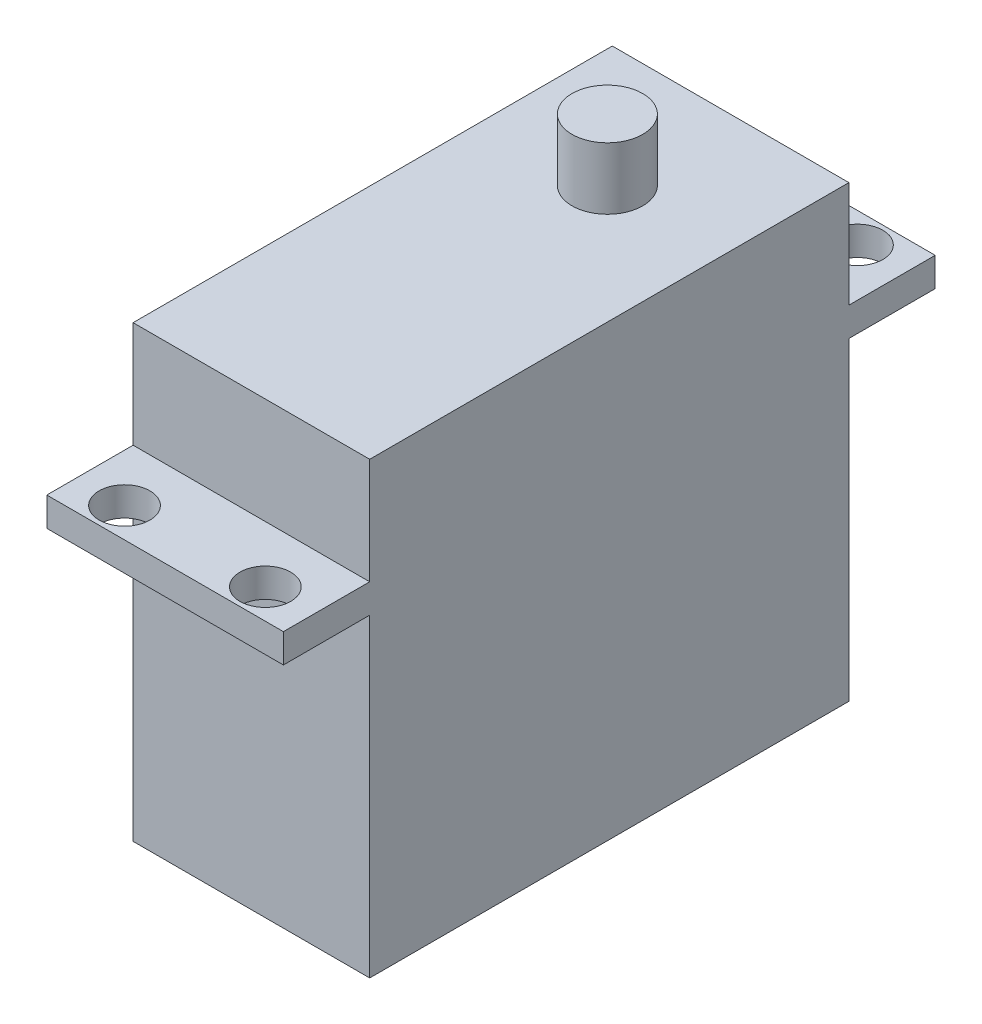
ISO-10303-21;
HEADER;
FILE_DESCRIPTION(('STEP AP214'),'2;1');
FILE_NAME('part.step','',(''),(''),'','','');
FILE_SCHEMA(('AUTOMOTIVE_DESIGN { 1 0 10303 214 1 1 1 1 }'));
ENDSEC;
DATA;
#1=APPLICATION_CONTEXT('core data for automotive mechanical design processes');
#2=APPLICATION_PROTOCOL_DEFINITION('international standard','automotive_design',2000,#1);
#3=PRODUCT_CONTEXT('',#1,'mechanical');
#4=PRODUCT('Part','Part','',(#3));
#5=PRODUCT_RELATED_PRODUCT_CATEGORY('part','',(#4));
#6=PRODUCT_DEFINITION_FORMATION('','',#4);
#7=PRODUCT_DEFINITION_CONTEXT('part definition',#1,'design');
#8=PRODUCT_DEFINITION('design','',#6,#7);
#9=PRODUCT_DEFINITION_SHAPE('','',#8);
#10=(LENGTH_UNIT() NAMED_UNIT(*) SI_UNIT(.MILLI.,.METRE.));
#11=(NAMED_UNIT(*) PLANE_ANGLE_UNIT() SI_UNIT($,.RADIAN.));
#12=(NAMED_UNIT(*) SI_UNIT($,.STERADIAN.) SOLID_ANGLE_UNIT());
#13=UNCERTAINTY_MEASURE_WITH_UNIT(LENGTH_MEASURE(1.E-05),#10,'distance_accuracy_value','');
#14=(GEOMETRIC_REPRESENTATION_CONTEXT(3) GLOBAL_UNCERTAINTY_ASSIGNED_CONTEXT((#13)) GLOBAL_UNIT_ASSIGNED_CONTEXT((#10,
#11,#12)) REPRESENTATION_CONTEXT('',''));
#15=CARTESIAN_POINT('',(0.,0.,0.));
#16=DIRECTION('',(0.,0.,1.));
#17=DIRECTION('',(1.,0.,0.));
#18=AXIS2_PLACEMENT_3D('',#15,#16,#17);
#19=CARTESIAN_POINT('',(-10.033,38.1,20.32));
#20=DIRECTION('',(0.,1.,0.));
#21=DIRECTION('',(0.,0.,1.));
#22=AXIS2_PLACEMENT_3D('',#19,#20,#21);
#23=PLANE('',#22);
#24=DIRECTION('',(0.,0.,1.));
#25=VECTOR('',#24,1.);
#26=CARTESIAN_POINT('',(-10.033,38.1,-20.32));
#27=LINE('',#26,#25);
#28=CARTESIAN_POINT('',(-10.033,38.1,-20.32));
#29=VERTEX_POINT('',#28);
#30=CARTESIAN_POINT('',(-10.033,38.1,20.32));
#31=VERTEX_POINT('',#30);
#32=EDGE_CURVE('E297',#29,#31,#27,.T.);
#33=ORIENTED_EDGE('',*,*,#32,.T.);
#34=DIRECTION('',(1.,0.,0.));
#35=VECTOR('',#34,1.);
#36=CARTESIAN_POINT('',(-10.033,38.1,20.32));
#37=LINE('',#36,#35);
#38=CARTESIAN_POINT('',(10.033,38.1,20.32));
#39=VERTEX_POINT('',#38);
#40=EDGE_CURVE('E298',#31,#39,#37,.T.);
#41=ORIENTED_EDGE('',*,*,#40,.T.);
#42=DIRECTION('',(0.,0.,-1.));
#43=VECTOR('',#42,1.);
#44=CARTESIAN_POINT('',(10.033,38.1,-20.32));
#45=LINE('',#44,#43);
#46=CARTESIAN_POINT('',(10.033,38.1,-20.32));
#47=VERTEX_POINT('',#46);
#48=EDGE_CURVE('E251',#39,#47,#45,.T.);
#49=ORIENTED_EDGE('',*,*,#48,.T.);
#50=DIRECTION('',(-1.,0.,0.));
#51=VECTOR('',#50,1.);
#52=CARTESIAN_POINT('',(-10.033,38.1,-20.32));
#53=LINE('',#52,#51);
#54=EDGE_CURVE('E306',#47,#29,#53,.T.);
#55=ORIENTED_EDGE('',*,*,#54,.T.);
#56=EDGE_LOOP('',(#33,#41,#49,#55));
#57=FACE_BOUND('',#56,.T.);
#58=CARTESIAN_POINT('',(0.,38.1,-9.87));
#59=DIRECTION('',(0.,1.,0.));
#60=DIRECTION('',(0.,0.,1.));
#61=AXIS2_PLACEMENT_3D('',#58,#59,#60);
#62=CIRCLE('',#61,3.);
#63=CARTESIAN_POINT('',(0.,38.1,-12.87));
#64=VERTEX_POINT('',#63);
#65=EDGE_CURVE('E194',#64,#64,#62,.T.);
#66=ORIENTED_EDGE('',*,*,#65,.F.);
#67=EDGE_LOOP('',(#66));
#68=FACE_BOUND('',#67,.T.);
#69=ADVANCED_FACE('F31',(#57,#68),#23,.T.);
#70=CARTESIAN_POINT('',(-10.033,38.1,-20.32));
#71=DIRECTION('',(0.,0.,1.));
#72=DIRECTION('',(1.,0.,0.));
#73=AXIS2_PLACEMENT_3D('',#70,#71,#72);
#74=PLANE('',#73);
#75=DIRECTION('',(0.,-1.,0.));
#76=VECTOR('',#75,1.);
#77=CARTESIAN_POINT('',(-10.033,38.1,-20.32));
#78=LINE('',#77,#76);
#79=CARTESIAN_POINT('',(-10.033,26.65,-20.32));
#80=VERTEX_POINT('',#79);
#81=CARTESIAN_POINT('',(-10.033,0.,-20.32));
#82=VERTEX_POINT('',#81);
#83=EDGE_CURVE('E270',#80,#82,#78,.T.);
#84=ORIENTED_EDGE('',*,*,#83,.F.);
#85=DIRECTION('',(1.,0.,0.));
#86=VECTOR('',#85,1.);
#87=CARTESIAN_POINT('',(-10.033,26.65,-20.32));
#88=LINE('',#87,#86);
#89=CARTESIAN_POINT('',(10.033,26.65,-20.32));
#90=VERTEX_POINT('',#89);
#91=EDGE_CURVE('E139',#80,#90,#88,.T.);
#92=ORIENTED_EDGE('',*,*,#91,.T.);
#93=DIRECTION('',(0.,-1.,0.));
#94=VECTOR('',#93,1.);
#95=CARTESIAN_POINT('',(10.033,38.1,-20.32));
#96=LINE('',#95,#94);
#97=CARTESIAN_POINT('',(10.033,0.,-20.32));
#98=VERTEX_POINT('',#97);
#99=EDGE_CURVE('E157',#90,#98,#96,.T.);
#100=ORIENTED_EDGE('',*,*,#99,.T.);
#101=DIRECTION('',(-1.,0.,0.));
#102=VECTOR('',#101,1.);
#103=CARTESIAN_POINT('',(-10.033,0.,-20.32));
#104=LINE('',#103,#102);
#105=EDGE_CURVE('E273',#98,#82,#104,.T.);
#106=ORIENTED_EDGE('',*,*,#105,.T.);
#107=EDGE_LOOP('',(#84,#92,#100,#106));
#108=FACE_BOUND('',#107,.T.);
#109=ADVANCED_FACE('F202',(#108),#74,.F.);
#110=CARTESIAN_POINT('',(-10.033,38.1,20.32));
#111=DIRECTION('',(0.,0.,-1.));
#112=DIRECTION('',(-1.,0.,0.));
#113=AXIS2_PLACEMENT_3D('',#110,#111,#112);
#114=PLANE('',#113);
#115=DIRECTION('',(-1.,0.,0.));
#116=VECTOR('',#115,1.);
#117=CARTESIAN_POINT('',(-10.033,29.1,20.32));
#118=LINE('',#117,#116);
#119=CARTESIAN_POINT('',(10.033,29.1,20.32));
#120=VERTEX_POINT('',#119);
#121=CARTESIAN_POINT('',(-10.033,29.1,20.32));
#122=VERTEX_POINT('',#121);
#123=EDGE_CURVE('E234',#120,#122,#118,.T.);
#124=ORIENTED_EDGE('',*,*,#123,.F.);
#125=DIRECTION('',(0.,-1.,0.));
#126=VECTOR('',#125,1.);
#127=CARTESIAN_POINT('',(10.033,38.1,20.32));
#128=LINE('',#127,#126);
#129=EDGE_CURVE('E236',#39,#120,#128,.T.);
#130=ORIENTED_EDGE('',*,*,#129,.F.);
#131=ORIENTED_EDGE('',*,*,#40,.F.);
#132=DIRECTION('',(0.,-1.,0.));
#133=VECTOR('',#132,1.);
#134=CARTESIAN_POINT('',(-10.033,38.1,20.32));
#135=LINE('',#134,#133);
#136=EDGE_CURVE('E11',#31,#122,#135,.T.);
#137=ORIENTED_EDGE('',*,*,#136,.T.);
#138=EDGE_LOOP('',(#124,#130,#131,#137));
#139=FACE_BOUND('',#138,.T.);
#140=ADVANCED_FACE('F208',(#139),#114,.F.);
#141=DIRECTION('',(1.,0.,0.));
#142=VECTOR('',#141,1.);
#143=CARTESIAN_POINT('',(-10.033,26.65,20.32));
#144=LINE('',#143,#142);
#145=CARTESIAN_POINT('',(-10.033,26.65,20.32));
#146=VERTEX_POINT('',#145);
#147=CARTESIAN_POINT('',(10.033,26.65,20.32));
#148=VERTEX_POINT('',#147);
#149=EDGE_CURVE('E56',#146,#148,#144,.T.);
#150=ORIENTED_EDGE('',*,*,#149,.F.);
#151=CARTESIAN_POINT('',(-10.033,0.,20.32));
#152=VERTEX_POINT('',#151);
#153=EDGE_CURVE('E40',#146,#152,#135,.T.);
#154=ORIENTED_EDGE('',*,*,#153,.T.);
#155=DIRECTION('',(1.,0.,0.));
#156=VECTOR('',#155,1.);
#157=CARTESIAN_POINT('',(-10.033,0.,20.32));
#158=LINE('',#157,#156);
#159=CARTESIAN_POINT('',(10.033,0.,20.32));
#160=VERTEX_POINT('',#159);
#161=EDGE_CURVE('E295',#152,#160,#158,.T.);
#162=ORIENTED_EDGE('',*,*,#161,.T.);
#163=EDGE_CURVE('E252',#148,#160,#128,.T.);
#164=ORIENTED_EDGE('',*,*,#163,.F.);
#165=EDGE_LOOP('',(#150,#154,#162,#164));
#166=FACE_BOUND('',#165,.T.);
#167=ADVANCED_FACE('F227',(#166),#114,.F.);
#168=CARTESIAN_POINT('',(-10.033,38.1,-20.32));
#169=DIRECTION('',(1.,0.,0.));
#170=DIRECTION('',(0.,0.,-1.));
#171=AXIS2_PLACEMENT_3D('',#168,#169,#170);
#172=PLANE('',#171);
#173=DIRECTION('',(0.,0.,1.));
#174=VECTOR('',#173,1.);
#175=CARTESIAN_POINT('',(-10.033,0.,-20.32));
#176=LINE('',#175,#174);
#177=EDGE_CURVE('E296',#82,#152,#176,.T.);
#178=ORIENTED_EDGE('',*,*,#177,.T.);
#179=ORIENTED_EDGE('',*,*,#153,.F.);
#180=DIRECTION('',(0.,0.,-1.));
#181=VECTOR('',#180,1.);
#182=CARTESIAN_POINT('',(-10.033,26.65,27.64));
#183=LINE('',#182,#181);
#184=CARTESIAN_POINT('',(-10.033,26.65,27.64));
#185=VERTEX_POINT('',#184);
#186=EDGE_CURVE('E260',#185,#146,#183,.T.);
#187=ORIENTED_EDGE('',*,*,#186,.F.);
#188=DIRECTION('',(0.,-1.,0.));
#189=VECTOR('',#188,1.);
#190=CARTESIAN_POINT('',(-10.033,29.1,27.64));
#191=LINE('',#190,#189);
#192=CARTESIAN_POINT('',(-10.033,29.1,27.64));
#193=VERTEX_POINT('',#192);
#194=EDGE_CURVE('E243',#193,#185,#191,.T.);
#195=ORIENTED_EDGE('',*,*,#194,.F.);
#196=DIRECTION('',(0.,0.,-1.));
#197=VECTOR('',#196,1.);
#198=CARTESIAN_POINT('',(-10.033,29.1,27.64));
#199=LINE('',#198,#197);
#200=EDGE_CURVE('E257',#193,#122,#199,.T.);
#201=ORIENTED_EDGE('',*,*,#200,.T.);
#202=ORIENTED_EDGE('',*,*,#136,.F.);
#203=ORIENTED_EDGE('',*,*,#32,.F.);
#204=CARTESIAN_POINT('',(-10.033,29.1,-20.32));
#205=VERTEX_POINT('',#204);
#206=EDGE_CURVE('E128',#29,#205,#78,.T.);
#207=ORIENTED_EDGE('',*,*,#206,.T.);
#208=DIRECTION('',(0.,0.,1.));
#209=VECTOR('',#208,1.);
#210=CARTESIAN_POINT('',(-10.033,29.1,-27.64));
#211=LINE('',#210,#209);
#212=CARTESIAN_POINT('',(-10.033,29.1,-27.64));
#213=VERTEX_POINT('',#212);
#214=EDGE_CURVE('E48',#213,#205,#211,.T.);
#215=ORIENTED_EDGE('',*,*,#214,.F.);
#216=DIRECTION('',(0.,-1.,0.));
#217=VECTOR('',#216,1.);
#218=CARTESIAN_POINT('',(-10.033,29.1,-27.64));
#219=LINE('',#218,#217);
#220=CARTESIAN_POINT('',(-10.033,26.65,-27.64));
#221=VERTEX_POINT('',#220);
#222=EDGE_CURVE('E124',#213,#221,#219,.T.);
#223=ORIENTED_EDGE('',*,*,#222,.T.);
#224=DIRECTION('',(0.,0.,1.));
#225=VECTOR('',#224,1.);
#226=CARTESIAN_POINT('',(-10.033,26.65,-27.64));
#227=LINE('',#226,#225);
#228=EDGE_CURVE('E148',#221,#80,#227,.T.);
#229=ORIENTED_EDGE('',*,*,#228,.T.);
#230=ORIENTED_EDGE('',*,*,#83,.T.);
#231=EDGE_LOOP('',(#178,#179,#187,#195,#201,#202,#203,#207,#215,#223,#229,#230));
#232=FACE_BOUND('',#231,.T.);
#233=ADVANCED_FACE('F33',(#232),#172,.F.);
#234=CARTESIAN_POINT('',(10.033,38.1,-20.32));
#235=DIRECTION('',(-1.,0.,0.));
#236=DIRECTION('',(0.,0.,1.));
#237=AXIS2_PLACEMENT_3D('',#234,#235,#236);
#238=PLANE('',#237);
#239=DIRECTION('',(0.,0.,-1.));
#240=VECTOR('',#239,1.);
#241=CARTESIAN_POINT('',(10.033,0.,-20.32));
#242=LINE('',#241,#240);
#243=EDGE_CURVE('E292',#160,#98,#242,.T.);
#244=ORIENTED_EDGE('',*,*,#243,.T.);
#245=ORIENTED_EDGE('',*,*,#99,.F.);
#246=DIRECTION('',(0.,0.,1.));
#247=VECTOR('',#246,1.);
#248=CARTESIAN_POINT('',(10.033,26.65,-27.64));
#249=LINE('',#248,#247);
#250=CARTESIAN_POINT('',(10.033,26.65,-27.64));
#251=VERTEX_POINT('',#250);
#252=EDGE_CURVE('E164',#251,#90,#249,.T.);
#253=ORIENTED_EDGE('',*,*,#252,.F.);
#254=DIRECTION('',(0.,1.,0.));
#255=VECTOR('',#254,1.);
#256=CARTESIAN_POINT('',(10.033,29.1,-27.64));
#257=LINE('',#256,#255);
#258=CARTESIAN_POINT('',(10.033,29.1,-27.64));
#259=VERTEX_POINT('',#258);
#260=EDGE_CURVE('E142',#251,#259,#257,.T.);
#261=ORIENTED_EDGE('',*,*,#260,.T.);
#262=DIRECTION('',(0.,0.,1.));
#263=VECTOR('',#262,1.);
#264=CARTESIAN_POINT('',(10.033,29.1,-27.64));
#265=LINE('',#264,#263);
#266=CARTESIAN_POINT('',(10.033,29.1,-20.32));
#267=VERTEX_POINT('',#266);
#268=EDGE_CURVE('E129',#259,#267,#265,.T.);
#269=ORIENTED_EDGE('',*,*,#268,.T.);
#270=EDGE_CURVE('E281',#47,#267,#96,.T.);
#271=ORIENTED_EDGE('',*,*,#270,.F.);
#272=ORIENTED_EDGE('',*,*,#48,.F.);
#273=ORIENTED_EDGE('',*,*,#129,.T.);
#274=DIRECTION('',(0.,0.,-1.));
#275=VECTOR('',#274,1.);
#276=CARTESIAN_POINT('',(10.033,29.1,27.64));
#277=LINE('',#276,#275);
#278=CARTESIAN_POINT('',(10.033,29.1,27.64));
#279=VERTEX_POINT('',#278);
#280=EDGE_CURVE('E248',#279,#120,#277,.T.);
#281=ORIENTED_EDGE('',*,*,#280,.F.);
#282=DIRECTION('',(0.,1.,0.));
#283=VECTOR('',#282,1.);
#284=CARTESIAN_POINT('',(10.033,29.1,27.64));
#285=LINE('',#284,#283);
#286=CARTESIAN_POINT('',(10.033,26.65,27.64));
#287=VERTEX_POINT('',#286);
#288=EDGE_CURVE('E317',#287,#279,#285,.T.);
#289=ORIENTED_EDGE('',*,*,#288,.F.);
#290=DIRECTION('',(0.,0.,-1.));
#291=VECTOR('',#290,1.);
#292=CARTESIAN_POINT('',(10.033,26.65,27.64));
#293=LINE('',#292,#291);
#294=EDGE_CURVE('E256',#287,#148,#293,.T.);
#295=ORIENTED_EDGE('',*,*,#294,.T.);
#296=ORIENTED_EDGE('',*,*,#163,.T.);
#297=EDGE_LOOP('',(#244,#245,#253,#261,#269,#271,#272,#273,#281,#289,#295,#296));
#298=FACE_BOUND('',#297,.T.);
#299=ADVANCED_FACE('F222',(#298),#238,.F.);
#300=ORIENTED_EDGE('',*,*,#270,.T.);
#301=DIRECTION('',(-1.,0.,0.));
#302=VECTOR('',#301,1.);
#303=CARTESIAN_POINT('',(-10.033,29.1,-20.32));
#304=LINE('',#303,#302);
#305=EDGE_CURVE('E154',#267,#205,#304,.T.);
#306=ORIENTED_EDGE('',*,*,#305,.T.);
#307=ORIENTED_EDGE('',*,*,#206,.F.);
#308=ORIENTED_EDGE('',*,*,#54,.F.);
#309=EDGE_LOOP('',(#300,#306,#307,#308));
#310=FACE_BOUND('',#309,.T.);
#311=ADVANCED_FACE('F211',(#310),#74,.F.);
#312=CARTESIAN_POINT('',(-10.033,0.,20.32));
#313=DIRECTION('',(0.,1.,0.));
#314=DIRECTION('',(0.,0.,1.));
#315=AXIS2_PLACEMENT_3D('',#312,#313,#314);
#316=PLANE('',#315);
#317=ORIENTED_EDGE('',*,*,#177,.F.);
#318=ORIENTED_EDGE('',*,*,#105,.F.);
#319=ORIENTED_EDGE('',*,*,#243,.F.);
#320=ORIENTED_EDGE('',*,*,#161,.F.);
#321=EDGE_LOOP('',(#317,#318,#319,#320));
#322=FACE_BOUND('',#321,.T.);
#323=ADVANCED_FACE('F217',(#322),#316,.F.);
#324=CARTESIAN_POINT('',(-10.033,26.65,27.64));
#325=DIRECTION('',(0.,1.,0.));
#326=DIRECTION('',(0.,0.,1.));
#327=AXIS2_PLACEMENT_3D('',#324,#325,#326);
#328=PLANE('',#327);
#329=CARTESIAN_POINT('',(-5.97058751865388,26.65,25.11));
#330=DIRECTION('',(0.,1.,0.));
#331=DIRECTION('',(0.,0.,1.));
#332=AXIS2_PLACEMENT_3D('',#329,#330,#331);
#333=CIRCLE('',#332,2.15264999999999);
#334=CARTESIAN_POINT('',(-5.97058751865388,26.65,27.26265));
#335=VERTEX_POINT('',#334);
#336=EDGE_CURVE('E376',#335,#335,#333,.T.);
#337=ORIENTED_EDGE('',*,*,#336,.T.);
#338=EDGE_LOOP('',(#337));
#339=FACE_BOUND('',#338,.T.);
#340=CARTESIAN_POINT('',(5.97058751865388,26.65,25.11));
#341=DIRECTION('',(0.,1.,0.));
#342=DIRECTION('',(0.,0.,1.));
#343=AXIS2_PLACEMENT_3D('',#340,#341,#342);
#344=CIRCLE('',#343,2.15264999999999);
#345=CARTESIAN_POINT('',(5.97058751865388,26.65,27.26265));
#346=VERTEX_POINT('',#345);
#347=EDGE_CURVE('E181',#346,#346,#344,.T.);
#348=ORIENTED_EDGE('',*,*,#347,.T.);
#349=EDGE_LOOP('',(#348));
#350=FACE_BOUND('',#349,.T.);
#351=ORIENTED_EDGE('',*,*,#149,.T.);
#352=ORIENTED_EDGE('',*,*,#294,.F.);
#353=DIRECTION('',(1.,0.,0.));
#354=VECTOR('',#353,1.);
#355=CARTESIAN_POINT('',(-10.033,26.65,27.64));
#356=LINE('',#355,#354);
#357=EDGE_CURVE('E316',#185,#287,#356,.T.);
#358=ORIENTED_EDGE('',*,*,#357,.F.);
#359=ORIENTED_EDGE('',*,*,#186,.T.);
#360=EDGE_LOOP('',(#351,#352,#358,#359));
#361=FACE_BOUND('',#360,.T.);
#362=ADVANCED_FACE('F215',(#339,#350,#361),#328,.F.);
#363=CARTESIAN_POINT('',(-10.033,29.1,27.64));
#364=DIRECTION('',(0.,-1.,0.));
#365=DIRECTION('',(0.,0.,-1.));
#366=AXIS2_PLACEMENT_3D('',#363,#364,#365);
#367=PLANE('',#366);
#368=CARTESIAN_POINT('',(-5.97058751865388,29.1,25.11));
#369=DIRECTION('',(0.,1.,0.));
#370=DIRECTION('',(0.,0.,1.));
#371=AXIS2_PLACEMENT_3D('',#368,#369,#370);
#372=CIRCLE('',#371,2.15264999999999);
#373=CARTESIAN_POINT('',(-5.97058751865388,29.1,27.26265));
#374=VERTEX_POINT('',#373);
#375=EDGE_CURVE('E373',#374,#374,#372,.T.);
#376=ORIENTED_EDGE('',*,*,#375,.F.);
#377=EDGE_LOOP('',(#376));
#378=FACE_BOUND('',#377,.T.);
#379=CARTESIAN_POINT('',(5.97058751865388,29.1,25.11));
#380=DIRECTION('',(0.,1.,0.));
#381=DIRECTION('',(0.,0.,1.));
#382=AXIS2_PLACEMENT_3D('',#379,#380,#381);
#383=CIRCLE('',#382,2.15264999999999);
#384=CARTESIAN_POINT('',(5.97058751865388,29.1,27.26265));
#385=VERTEX_POINT('',#384);
#386=EDGE_CURVE('E176',#385,#385,#383,.T.);
#387=ORIENTED_EDGE('',*,*,#386,.F.);
#388=EDGE_LOOP('',(#387));
#389=FACE_BOUND('',#388,.T.);
#390=ORIENTED_EDGE('',*,*,#123,.T.);
#391=ORIENTED_EDGE('',*,*,#200,.F.);
#392=DIRECTION('',(-1.,0.,0.));
#393=VECTOR('',#392,1.);
#394=CARTESIAN_POINT('',(-10.033,29.1,27.64));
#395=LINE('',#394,#393);
#396=EDGE_CURVE('E255',#279,#193,#395,.T.);
#397=ORIENTED_EDGE('',*,*,#396,.F.);
#398=ORIENTED_EDGE('',*,*,#280,.T.);
#399=EDGE_LOOP('',(#390,#391,#397,#398));
#400=FACE_BOUND('',#399,.T.);
#401=ADVANCED_FACE('F254',(#378,#389,#400),#367,.F.);
#402=CARTESIAN_POINT('',(-10.033,26.65,27.64));
#403=DIRECTION('',(0.,0.,1.));
#404=DIRECTION('',(1.,0.,0.));
#405=AXIS2_PLACEMENT_3D('',#402,#403,#404);
#406=PLANE('',#405);
#407=ORIENTED_EDGE('',*,*,#194,.T.);
#408=ORIENTED_EDGE('',*,*,#357,.T.);
#409=ORIENTED_EDGE('',*,*,#288,.T.);
#410=ORIENTED_EDGE('',*,*,#396,.T.);
#411=EDGE_LOOP('',(#407,#408,#409,#410));
#412=FACE_BOUND('',#411,.T.);
#413=ADVANCED_FACE('F331',(#412),#406,.T.);
#414=CARTESIAN_POINT('',(-10.033,29.1,-27.64));
#415=DIRECTION('',(0.,1.,0.));
#416=DIRECTION('',(0.,0.,1.));
#417=AXIS2_PLACEMENT_3D('',#414,#415,#416);
#418=PLANE('',#417);
#419=CARTESIAN_POINT('',(-5.97058751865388,29.1,-25.11));
#420=DIRECTION('',(0.,1.,0.));
#421=DIRECTION('',(0.,0.,1.));
#422=AXIS2_PLACEMENT_3D('',#419,#420,#421);
#423=CIRCLE('',#422,2.15264999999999);
#424=CARTESIAN_POINT('',(-5.97058751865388,29.1,-22.95735));
#425=VERTEX_POINT('',#424);
#426=EDGE_CURVE('E188',#425,#425,#423,.T.);
#427=ORIENTED_EDGE('',*,*,#426,.F.);
#428=EDGE_LOOP('',(#427));
#429=FACE_BOUND('',#428,.T.);
#430=CARTESIAN_POINT('',(5.97058751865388,29.1,-25.11));
#431=DIRECTION('',(0.,1.,0.));
#432=DIRECTION('',(0.,0.,1.));
#433=AXIS2_PLACEMENT_3D('',#430,#431,#432);
#434=CIRCLE('',#433,2.15264999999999);
#435=CARTESIAN_POINT('',(5.97058751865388,29.1,-22.95735));
#436=VERTEX_POINT('',#435);
#437=EDGE_CURVE('E177',#436,#436,#434,.T.);
#438=ORIENTED_EDGE('',*,*,#437,.F.);
#439=EDGE_LOOP('',(#438));
#440=FACE_BOUND('',#439,.T.);
#441=ORIENTED_EDGE('',*,*,#305,.F.);
#442=ORIENTED_EDGE('',*,*,#268,.F.);
#443=DIRECTION('',(-1.,0.,0.));
#444=VECTOR('',#443,1.);
#445=CARTESIAN_POINT('',(-10.033,29.1,-27.64));
#446=LINE('',#445,#444);
#447=EDGE_CURVE('E135',#259,#213,#446,.T.);
#448=ORIENTED_EDGE('',*,*,#447,.T.);
#449=ORIENTED_EDGE('',*,*,#214,.T.);
#450=EDGE_LOOP('',(#441,#442,#448,#449));
#451=FACE_BOUND('',#450,.T.);
#452=ADVANCED_FACE('F141',(#429,#440,#451),#418,.T.);
#453=CARTESIAN_POINT('',(-10.033,26.65,-27.64));
#454=DIRECTION('',(0.,-1.,0.));
#455=DIRECTION('',(0.,0.,-1.));
#456=AXIS2_PLACEMENT_3D('',#453,#454,#455);
#457=PLANE('',#456);
#458=CARTESIAN_POINT('',(-5.97058751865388,26.65,-25.11));
#459=DIRECTION('',(0.,-1.,0.));
#460=DIRECTION('',(0.,0.,-1.));
#461=AXIS2_PLACEMENT_3D('',#458,#459,#460);
#462=CIRCLE('',#461,2.15264999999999);
#463=CARTESIAN_POINT('',(-5.97058751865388,26.65,-27.26265));
#464=VERTEX_POINT('',#463);
#465=EDGE_CURVE('E35',#464,#464,#462,.T.);
#466=ORIENTED_EDGE('',*,*,#465,.F.);
#467=EDGE_LOOP('',(#466));
#468=FACE_BOUND('',#467,.T.);
#469=CARTESIAN_POINT('',(5.97058751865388,26.65,-25.11));
#470=DIRECTION('',(0.,-1.,0.));
#471=DIRECTION('',(0.,0.,-1.));
#472=AXIS2_PLACEMENT_3D('',#469,#470,#471);
#473=CIRCLE('',#472,2.15264999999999);
#474=CARTESIAN_POINT('',(5.97058751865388,26.65,-27.26265));
#475=VERTEX_POINT('',#474);
#476=EDGE_CURVE('E174',#475,#475,#473,.T.);
#477=ORIENTED_EDGE('',*,*,#476,.F.);
#478=EDGE_LOOP('',(#477));
#479=FACE_BOUND('',#478,.T.);
#480=ORIENTED_EDGE('',*,*,#91,.F.);
#481=ORIENTED_EDGE('',*,*,#228,.F.);
#482=DIRECTION('',(1.,0.,0.));
#483=VECTOR('',#482,1.);
#484=CARTESIAN_POINT('',(-10.033,26.65,-27.64));
#485=LINE('',#484,#483);
#486=EDGE_CURVE('E138',#221,#251,#485,.T.);
#487=ORIENTED_EDGE('',*,*,#486,.T.);
#488=ORIENTED_EDGE('',*,*,#252,.T.);
#489=EDGE_LOOP('',(#480,#481,#487,#488));
#490=FACE_BOUND('',#489,.T.);
#491=ADVANCED_FACE('F312',(#468,#479,#490),#457,.T.);
#492=CARTESIAN_POINT('',(-10.033,26.65,-27.64));
#493=DIRECTION('',(0.,0.,-1.));
#494=DIRECTION('',(1.,0.,0.));
#495=AXIS2_PLACEMENT_3D('',#492,#493,#494);
#496=PLANE('',#495);
#497=ORIENTED_EDGE('',*,*,#222,.F.);
#498=ORIENTED_EDGE('',*,*,#447,.F.);
#499=ORIENTED_EDGE('',*,*,#260,.F.);
#500=ORIENTED_EDGE('',*,*,#486,.F.);
#501=EDGE_LOOP('',(#497,#498,#499,#500));
#502=FACE_BOUND('',#501,.T.);
#503=ADVANCED_FACE('F133',(#502),#496,.T.);
#504=CARTESIAN_POINT('',(0.,43.35,-9.87));
#505=DIRECTION('',(0.,-1.,0.));
#506=DIRECTION('',(0.,0.,-1.));
#507=AXIS2_PLACEMENT_3D('',#504,#505,#506);
#508=CYLINDRICAL_SURFACE('',#507,3.);
#509=CARTESIAN_POINT('',(0.,43.35,-9.87));
#510=DIRECTION('',(0.,1.,0.));
#511=DIRECTION('',(0.,0.,1.));
#512=AXIS2_PLACEMENT_3D('',#509,#510,#511);
#513=CIRCLE('',#512,3.);
#514=CARTESIAN_POINT('',(0.,43.35,-12.87));
#515=VERTEX_POINT('',#514);
#516=EDGE_CURVE('E156',#515,#515,#513,.T.);
#517=CARTESIAN_POINT('',(0.,43.35,-12.87));
#518=CARTESIAN_POINT('',(0.,43.2953125,-12.87));
#519=CARTESIAN_POINT('',(0.,43.240625,-12.87));
#520=CARTESIAN_POINT('',(0.,43.13125,-12.87));
#521=CARTESIAN_POINT('',(0.,43.0765625,-12.87));
#522=CARTESIAN_POINT('',(0.,42.9671875,-12.87));
#523=CARTESIAN_POINT('',(0.,42.9125,-12.87));
#524=CARTESIAN_POINT('',(0.,42.803125,-12.87));
#525=CARTESIAN_POINT('',(0.,42.7484375,-12.87));
#526=CARTESIAN_POINT('',(0.,42.6390625,-12.87));
#527=CARTESIAN_POINT('',(0.,42.584375,-12.87));
#528=CARTESIAN_POINT('',(0.,42.475,-12.87));
#529=CARTESIAN_POINT('',(0.,42.4203125,-12.87));
#530=CARTESIAN_POINT('',(0.,42.3109375,-12.87));
#531=CARTESIAN_POINT('',(0.,42.25625,-12.87));
#532=CARTESIAN_POINT('',(0.,42.146875,-12.87));
#533=CARTESIAN_POINT('',(0.,42.0921875,-12.87));
#534=CARTESIAN_POINT('',(0.,41.9828125,-12.87));
#535=CARTESIAN_POINT('',(0.,41.928125,-12.87));
#536=CARTESIAN_POINT('',(0.,41.81875,-12.87));
#537=CARTESIAN_POINT('',(0.,41.7640625,-12.87));
#538=CARTESIAN_POINT('',(0.,41.6546875,-12.87));
#539=CARTESIAN_POINT('',(0.,41.6,-12.87));
#540=CARTESIAN_POINT('',(0.,41.490625,-12.87));
#541=CARTESIAN_POINT('',(0.,41.4359375,-12.87));
#542=CARTESIAN_POINT('',(0.,41.3265625,-12.87));
#543=CARTESIAN_POINT('',(0.,41.271875,-12.87));
#544=CARTESIAN_POINT('',(0.,41.1625,-12.87));
#545=CARTESIAN_POINT('',(0.,41.1078125,-12.87));
#546=CARTESIAN_POINT('',(0.,40.9984375,-12.87));
#547=CARTESIAN_POINT('',(0.,40.94375,-12.87));
#548=CARTESIAN_POINT('',(0.,40.834375,-12.87));
#549=CARTESIAN_POINT('',(0.,40.7796875,-12.87));
#550=CARTESIAN_POINT('',(0.,40.6703125,-12.87));
#551=CARTESIAN_POINT('',(0.,40.615625,-12.87));
#552=CARTESIAN_POINT('',(0.,40.50625,-12.87));
#553=CARTESIAN_POINT('',(0.,40.4515625,-12.87));
#554=CARTESIAN_POINT('',(0.,40.3421875,-12.87));
#555=CARTESIAN_POINT('',(0.,40.2875,-12.87));
#556=CARTESIAN_POINT('',(0.,40.178125,-12.87));
#557=CARTESIAN_POINT('',(0.,40.1234375,-12.87));
#558=CARTESIAN_POINT('',(0.,40.0140625,-12.87));
#559=CARTESIAN_POINT('',(0.,39.959375,-12.87));
#560=CARTESIAN_POINT('',(0.,39.85,-12.87));
#561=CARTESIAN_POINT('',(0.,39.7953125,-12.87));
#562=CARTESIAN_POINT('',(0.,39.6859375,-12.87));
#563=CARTESIAN_POINT('',(0.,39.63125,-12.87));
#564=CARTESIAN_POINT('',(0.,39.521875,-12.87));
#565=CARTESIAN_POINT('',(0.,39.4671875,-12.87));
#566=CARTESIAN_POINT('',(0.,39.3578125,-12.87));
#567=CARTESIAN_POINT('',(0.,39.303125,-12.87));
#568=CARTESIAN_POINT('',(0.,39.19375,-12.87));
#569=CARTESIAN_POINT('',(0.,39.1390625,-12.87));
#570=CARTESIAN_POINT('',(0.,39.0296875,-12.87));
#571=CARTESIAN_POINT('',(0.,38.975,-12.87));
#572=CARTESIAN_POINT('',(0.,38.865625,-12.87));
#573=CARTESIAN_POINT('',(0.,38.8109375,-12.87));
#574=CARTESIAN_POINT('',(0.,38.7015625,-12.87));
#575=CARTESIAN_POINT('',(0.,38.646875,-12.87));
#576=CARTESIAN_POINT('',(0.,38.5375,-12.87));
#577=CARTESIAN_POINT('',(0.,38.4828125,-12.87));
#578=CARTESIAN_POINT('',(0.,38.3734375,-12.87));
#579=CARTESIAN_POINT('',(0.,38.31875,-12.87));
#580=CARTESIAN_POINT('',(0.,38.209375,-12.87));
#581=CARTESIAN_POINT('',(0.,38.1546875,-12.87));
#582=CARTESIAN_POINT('',(0.,38.1,-12.87));
#583=B_SPLINE_CURVE_WITH_KNOTS('',3,(#517,#518,#519,#520,#521,#522,#523,#524,#525,#526,#527,
#528,#529,#530,#531,#532,#533,#534,#535,#536,#537,#538,#539,#540,#541,#542,#543,#544,#545,#546,
#547,#548,#549,#550,#551,#552,#553,#554,#555,#556,#557,#558,#559,#560,#561,#562,#563,#564,#565,
#566,#567,#568,#569,#570,#571,#572,#573,#574,#575,#576,#577,#578,#579,#580,#581,#582),
.UNSPECIFIED.,.F.,.F.,(4,2,2,2,2,2,2,2,2,2,2,2,2,2,2,2,2,2,2,2,2,2,2,2,2,2,2,2,2,2,2,2,4),(0.,
0.164062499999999,0.328124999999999,0.492187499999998,0.656249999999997,0.820312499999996,
0.984374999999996,1.14843749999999,1.31249999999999,1.47656249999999,1.64062499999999,
1.80468749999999,1.96875,2.1328125,2.296875,2.4609375,2.625,2.78906249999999,2.95312499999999,
3.11718749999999,3.28124999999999,3.44531249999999,3.60937499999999,3.7734375,3.9375,4.1015625,
4.26562499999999,4.42968749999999,4.59374999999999,4.75781249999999,4.92187499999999,
5.08593749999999,5.24999999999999),.UNSPECIFIED.);
#584=EDGE_CURVE('BSEAM199',#515,#64,#583,.T.);
#585=ORIENTED_EDGE('',*,*,#516,.F.);
#586=ORIENTED_EDGE('',*,*,#65,.T.);
#587=ORIENTED_EDGE('',*,*,#584,.T.);
#588=ORIENTED_EDGE('',*,*,#584,.F.);
#589=EDGE_LOOP('',(#585,#587,#586,#588));
#590=FACE_BOUND('',#589,.T.);
#591=ADVANCED_FACE('F199',(#590),#508,.T.);
#592=CARTESIAN_POINT('',(0.,43.35,-9.87));
#593=DIRECTION('',(0.,1.,0.));
#594=DIRECTION('',(0.,0.,1.));
#595=AXIS2_PLACEMENT_3D('',#592,#593,#594);
#596=PLANE('',#595);
#597=ORIENTED_EDGE('',*,*,#516,.T.);
#598=EDGE_LOOP('',(#597));
#599=FACE_BOUND('',#598,.T.);
#600=ADVANCED_FACE('F349',(#599),#596,.T.);
#601=CARTESIAN_POINT('',(5.97058751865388,29.1,25.11));
#602=DIRECTION('',(0.,1.,0.));
#603=DIRECTION('',(0.,0.,1.));
#604=AXIS2_PLACEMENT_3D('',#601,#602,#603);
#605=CYLINDRICAL_SURFACE('',#604,2.15264999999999);
#606=ORIENTED_EDGE('',*,*,#386,.T.);
#607=EDGE_LOOP('',(#606));
#608=FACE_BOUND('',#607,.T.);
#609=ORIENTED_EDGE('',*,*,#347,.F.);
#610=EDGE_LOOP('',(#609));
#611=FACE_BOUND('',#610,.T.);
#612=ADVANCED_FACE('F353',(#608,#611),#605,.F.);
#613=CARTESIAN_POINT('',(5.97058751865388,29.1,-25.11));
#614=DIRECTION('',(0.,1.,0.));
#615=DIRECTION('',(0.,0.,1.));
#616=AXIS2_PLACEMENT_3D('',#613,#614,#615);
#617=CYLINDRICAL_SURFACE('',#616,2.15264999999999);
#618=ORIENTED_EDGE('',*,*,#476,.T.);
#619=EDGE_LOOP('',(#618));
#620=FACE_BOUND('',#619,.T.);
#621=ORIENTED_EDGE('',*,*,#437,.T.);
#622=EDGE_LOOP('',(#621));
#623=FACE_BOUND('',#622,.T.);
#624=ADVANCED_FACE('F357',(#620,#623),#617,.F.);
#625=CARTESIAN_POINT('',(-5.97058751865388,29.1,-25.11));
#626=DIRECTION('',(0.,1.,0.));
#627=DIRECTION('',(0.,0.,1.));
#628=AXIS2_PLACEMENT_3D('',#625,#626,#627);
#629=CYLINDRICAL_SURFACE('',#628,2.15264999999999);
#630=ORIENTED_EDGE('',*,*,#465,.T.);
#631=EDGE_LOOP('',(#630));
#632=FACE_BOUND('',#631,.T.);
#633=ORIENTED_EDGE('',*,*,#426,.T.);
#634=EDGE_LOOP('',(#633));
#635=FACE_BOUND('',#634,.T.);
#636=ADVANCED_FACE('F361',(#632,#635),#629,.F.);
#637=CARTESIAN_POINT('',(-5.97058751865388,29.1,25.11));
#638=DIRECTION('',(0.,1.,0.));
#639=DIRECTION('',(0.,0.,1.));
#640=AXIS2_PLACEMENT_3D('',#637,#638,#639);
#641=CYLINDRICAL_SURFACE('',#640,2.15264999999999);
#642=ORIENTED_EDGE('',*,*,#375,.T.);
#643=EDGE_LOOP('',(#642));
#644=FACE_BOUND('',#643,.T.);
#645=ORIENTED_EDGE('',*,*,#336,.F.);
#646=EDGE_LOOP('',(#645));
#647=FACE_BOUND('',#646,.T.);
#648=ADVANCED_FACE('F364',(#644,#647),#641,.F.);
#649=CLOSED_SHELL('',(#69,#109,#140,#167,#233,#299,#311,#323,#362,#401,#413,#452,#491,#503,#591,
#600,#612,#624,#636,#648));
#650=MANIFOLD_SOLID_BREP('B2',#649);
#651=ADVANCED_BREP_SHAPE_REPRESENTATION('',(#18,#650),#14);
#652=SHAPE_DEFINITION_REPRESENTATION(#9,#651);
ENDSEC;
END-ISO-10303-21;
